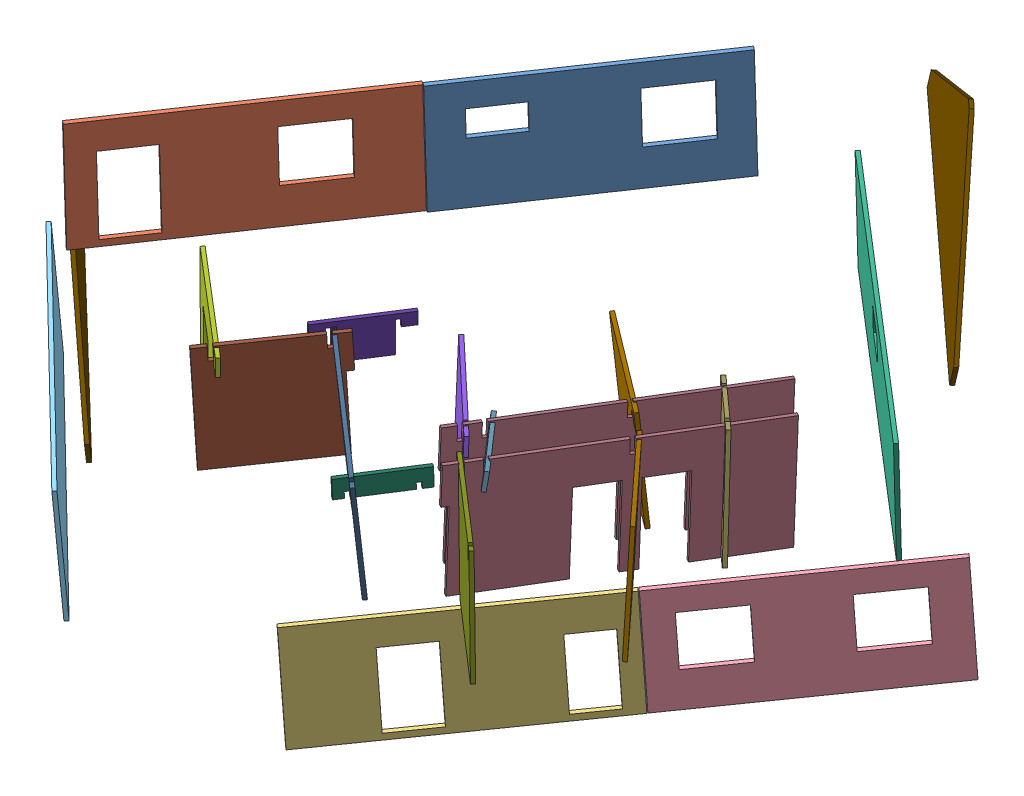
SolidWorks assembly Assemblage_doublage-notes.SLDASM, configuration Défaut (file format 3400). Lengths in mm.
Overall size (669.78 494.73 452.14).
25 component instances, 18 part files, 0 mates.
Components (placement in the parent):
- Assemblage_ar-1: Assemblage_ar.SLDASM [Défaut] at (130.6887 402.6755 -137.1338) x (-0.612547 -0.045389 0.78913) z (-0.780123 0.195447 -0.594314) size (405.44 107.56 3.75)
  - doublage_AR-G-1: doublage_AR-G.SLDPRT [Défaut] at (-175.6761 -67.5433 -1.5) size (194 107 3)
  - doublage_AR-D-1: doublage_AR-D.SLDPRT [Défaut] at (18.7626 -66.9799 -0.75) size (211 107 3)
- Assemblage_av-1: Assemblage_av.SLDASM [Défaut] at (274.2759 137.1683 -115.5322) x (0.646412 0.066565 -0.760079) z (0.75243 -0.220765 0.620574) size (404.62 107.13 3)
  - doublage_AV-G-1: doublage_AV-G.SLDPRT [Défaut] at (-190.3343 -84.9678 0) size (211 107 3)
  - doublage_AV-D-1: doublage_AV-D.SLDPRT [Défaut] at (21.2894 -84.8365 0) size (193 107 3)
- doublage_G-1: doublage_G.SLDPRT [Défaut] at (36.4559 213.5901 96.7267) x (-0.707846 0.167409 -0.686242) z (-0.702653 -0.067395 0.708333) size (222 107 3)
- doublage_D-1: doublage_D.SLDPRT [Défaut] at (340.2527 345.225 -262.547) x (0.749921 -0.261228 0.607766) z (-0.637879 -0.042091 0.768986) size (222 107 3)
- Assemblage_cloisons-1: Assemblage_cloisons.SLDASM [Défaut] at (-43.6362 -214.0239 -81.6235) size (415.11 154.29 264.52)
  - cloison_1B-3: cloison_1B.SLDPRT [Défaut] at (74.5946 447.1914 50.6035) x (0.764191 -0.094644 0.638008) z (-0.641668 -0.011289 0.7669) size (100 95 3)
  - cloison_1A-3: cloison_1A.SLDPRT [Défaut] at (280.1158 480.068 48.1056) x (0.72833 -0.019648 0.684945) z (-0.684276 0.031801 0.72853) size (100 95 3)
  - cloison_1-4: cloison_1.SLDPRT [Défaut] at (483.6259 477.0679 116.9628) x (-0.678394 -0.021693 -0.734378) z (0.734411 -0.047941 -0.677009) size (100 95 3)
  - cloison_4-2: cloison_4.SLDPRT [Défaut] at (176.6687 446.955 35.6224) x (0.750791 -0.190236 0.632552) z (-0.655039 -0.091104 0.750083) size (136 95 3)
  - cloison_3-2: cloison_3.SLDPRT [Défaut] at (132.4761 439.3974 115.4567) x (0.632975 0.058443 -0.771963) z (0.772672 -0.109745 0.625247) size (95 95 3)
  - cloison_5-1: cloison_5.SLDPRT [Défaut] at (414.8611 473.2541 -34.0063) x (0.740875 0.049244 0.669835) z (-0.671345 0.024623 0.740736) size (60 95 3)
  - cloison_2-1: cloison_2.SLDPRT [Défaut] at (361.1564 478.846 147.4618) x (0.49107 -0.023397 -0.870806) z (0.870497 -0.024621 0.491557) size (215 95 3)
  - cloison_2-2: cloison_2.SLDPRT [Défaut] at (338.2871 479.9022 125.9804) x (0.472266 -0.041086 -0.880498) z (0.881451 0.025548 0.471585) size (215 95 3)
  - cloison_1A-4: cloison_1A.SLDPRT [Défaut] at (583.5876 410.5849 -185.2988) x (-0.999644 0.026687 0) z (0 0 -1) size (100 95 3) (suppressed, hidden)
  - traverse_7-1: traverse_7.SLDPRT [Défaut] at (347.2424 557.5455 86.8917) x (0.658205 -0.015221 0.752685) z (-0.744368 0.136401 0.653691) size (60 15 3)
  - traverse_8-1: traverse_8.SLDPRT [Défaut] at (269.0219 499.2769 141.3262) x (0.57789 0.034978 -0.815365) z (0.816081 -0.033806 0.576948) size (60 15 3)
  - cloison_1C-1: cloison_1C.SLDPRT [Défaut] at (437.5738 477.2907 195.7667) x (-0.755592 0.002336 -0.655038) z (0.655026 0.009727 -0.755544) size (100 95 3)
  - cloison_1-5: cloison_1.SLDPRT [Défaut] at (328.272 477.0468 -43.8452) x (0.80035 -0.025425 0.598993) z (-0.598495 -0.092655 0.795751) size (100 95 3)
  - traverse_6-1: traverse_6.SLDPRT [Défaut] at (215.277 513.2028 16.3017) x (-0.558037 -0.014965 0.829681) z (-0.829312 0.044878 -0.55698) size (65 30 3)
- cloison_G-D_H-1: cloison_G-D_H.SLDPRT [Défaut] at (496.068 381.4279 -177.7467) x (-0.731441 0.190484 -0.65476) z (0.638647 -0.145188 -0.755679) size (240 112 3)
- cloison_G-D_H-2: cloison_G-D_H.SLDPRT [Défaut] at (26.943 211.8776 62.8448) x (-0.713469 0.168776 -0.680057) z (0.697976 0.085889 -0.710952) size (240 112 3)
